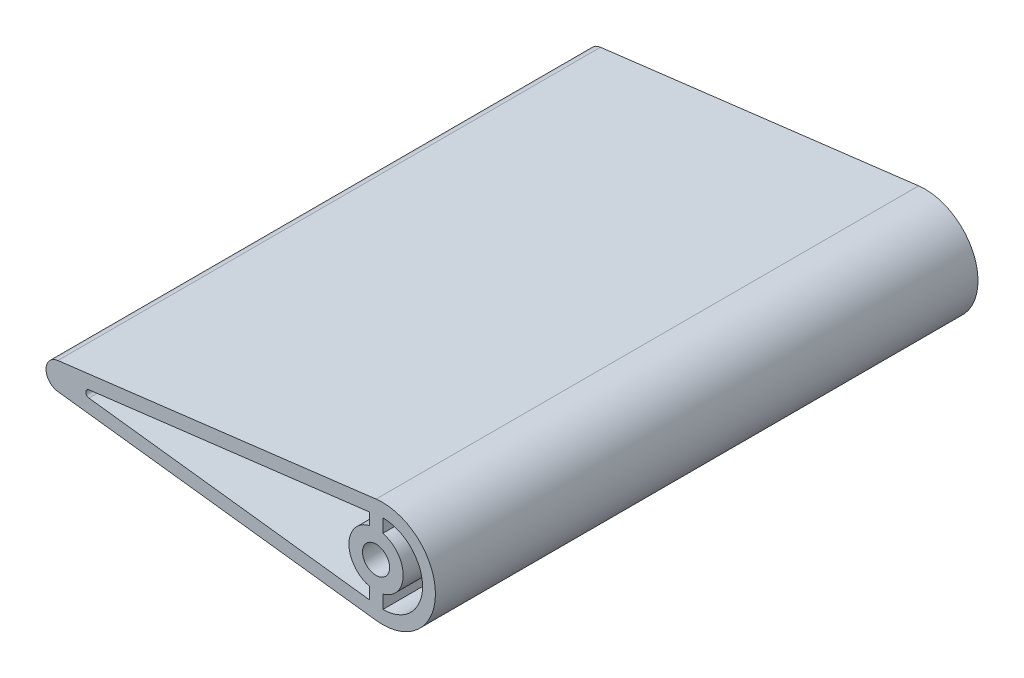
from build123d import *

# Parameters (mm, degrees)
ESQUISSE1_R        = 3
BOSS_EXTRU_1_DEPTH = 120
CONG_1_R           = 3


with BuildPart() as part:
    # Esquisse1 → Boss.-Extru.1 (new body)
    with BuildSketch(Plane.XY):
        with BuildLine():
            Line((-94.616527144, 0), (0, 11.61744874))
            ThreePointArc((0, 11.61744874), (13.131137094, 0), (0, -11.61744874))
            Line((0, -11.61744874), (-94.616527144, 0))
        make_face()
        with Locations(Location((0, 0, 0), (0, 0, 180))):
            Circle(ESQUISSE1_R, mode=Mode.SUBTRACT)
        with BuildLine():
            Line((-63.496985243, 0.798469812), (-1.5, 8.410742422))
            Line((-1.5, 8.410742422), (-1.5, 5.809475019))
            ThreePointArc((-1.5, 5.809475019), (-6, 0), (-1.5, -5.809475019))
            Line((-1.5, -5.809475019), (-1.5, -8.410742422))
            Line((-1.5, -8.410742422), (-63.496985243, -0.798469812))
            ThreePointArc((-63.496985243, -0.798469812), (-64.187284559, 0), (-63.496985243, 0.798469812))
        make_face(mode=Mode.SUBTRACT)
        with BuildLine():
            Line((1.5, 8.779096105), (1.5, 5.809475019))
            ThreePointArc((1.5, 5.809475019), (6, 0), (1.5, -5.809475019))
            Line((1.5, -5.809475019), (1.5, -8.779096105))
            ThreePointArc((1.5, -8.779096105), (10.279096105, 0), (1.5, 8.779096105))
        make_face(mode=Mode.SUBTRACT)
    extrude(amount=BOSS_EXTRU_1_DEPTH)

    # Cong_1
    cong_1_edges = [part.edges().sort_by_distance(p)[0] for p in [
        (-94.616527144, 0, 60),
    ]]
    fillet(cong_1_edges, radius=CONG_1_R)


solid = part.part
